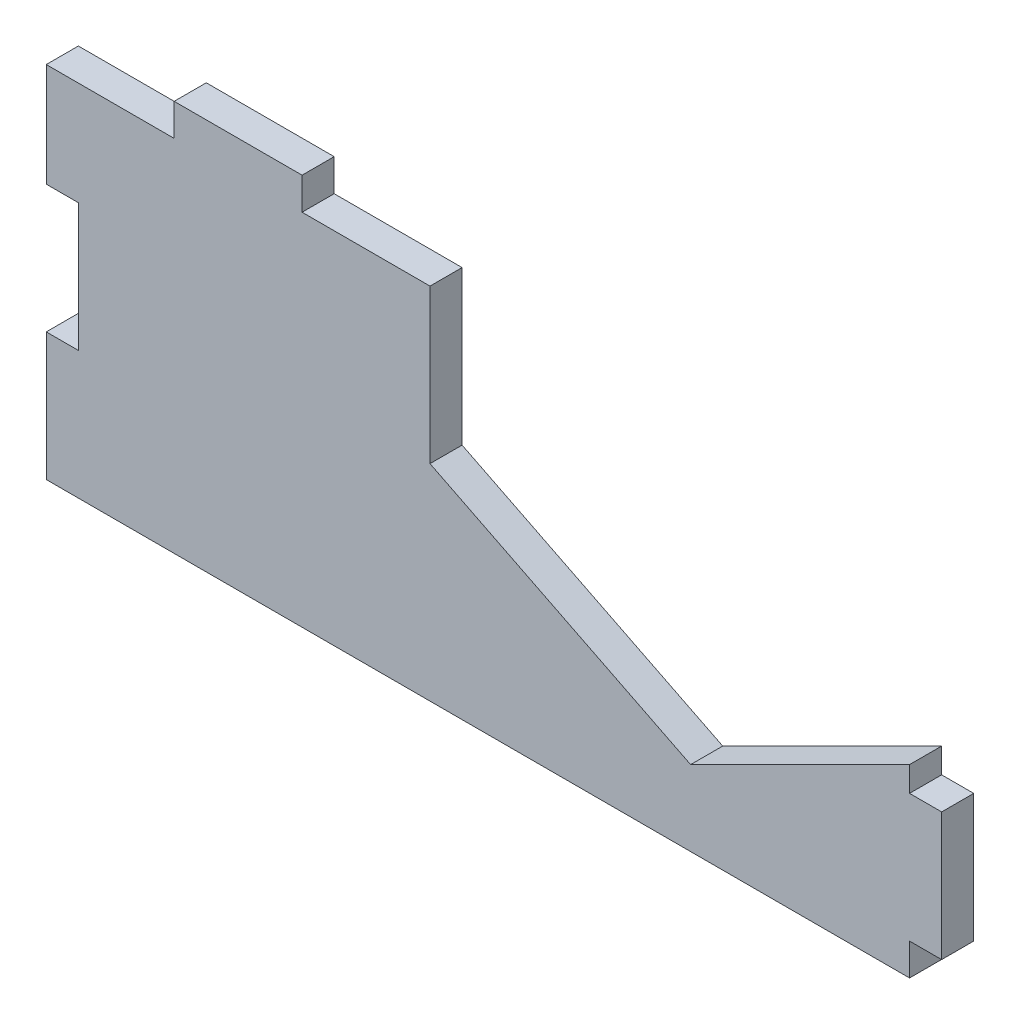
from build123d import *

# Parameters (mm, degrees)
BOSS_EXTRUDE1_DEPTH = 19


with BuildPart() as part:
    # Sketch1 → Boss-Extrude1 (new body)
    with BuildSketch(Plane.XY):
        Polygon((-590.886476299, 277.322898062), (-590.886476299, 201.609079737), (-79.886476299, 201.609079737), (-79.886476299, 220.537183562), (-60.886476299, 220.537183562), (-60.886476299, 296.251001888), (-79.886476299, 296.251001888), (-79.886476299, 311.003752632), (-209.47407294, 246.209954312), (-363.745021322, 323.345428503), (-363.745021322, 414.365288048), (-439.458839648, 414.365288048), (-439.458839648, 433.365288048), (-515.172657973, 433.365288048), (-515.172657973, 414.365288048), (-590.886476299, 414.365288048), (-590.886476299, 353.036716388), (-571.886476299, 353.036716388), (-571.886476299, 277.322898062), align=None)
    extrude(amount=BOSS_EXTRUDE1_DEPTH)


solid = part.part
